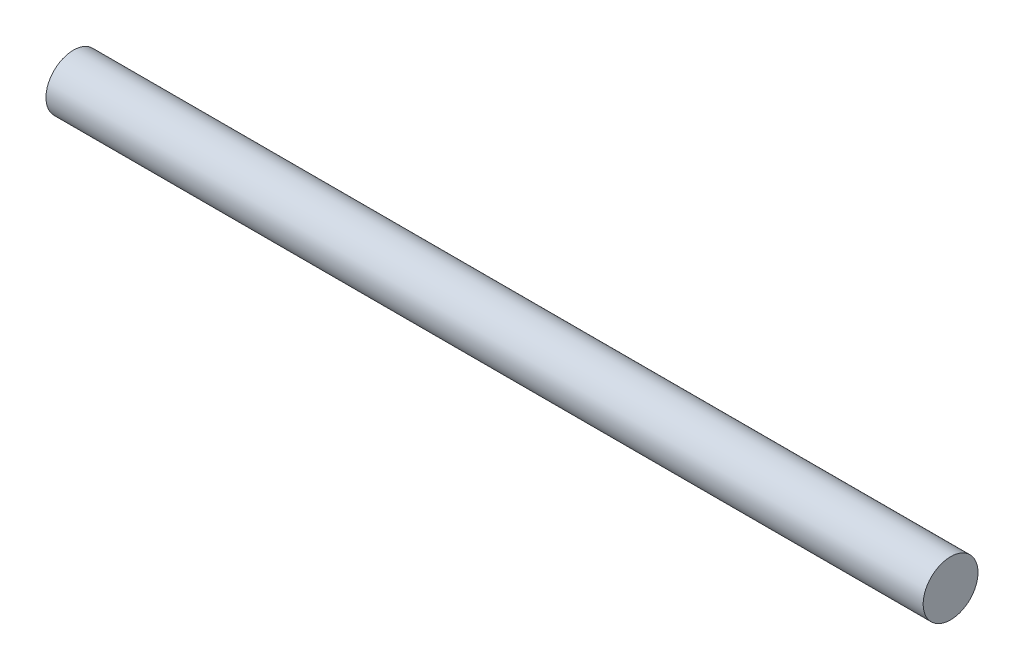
from build123d import *

# Parameters (mm, degrees)
SKETCH1_R           = 12.7
BOSS_EXTRUDE1_DEPTH = 406.4


with BuildPart() as part:
    # Sketch1 → Boss-Extrude1 (new body)
    with BuildSketch(Plane(origin=(0, 0, 0), x_dir=(0, 0, -1), z_dir=(1, 0, 0))):
        Circle(SKETCH1_R)
    extrude(amount=BOSS_EXTRUDE1_DEPTH)


solid = part.part
